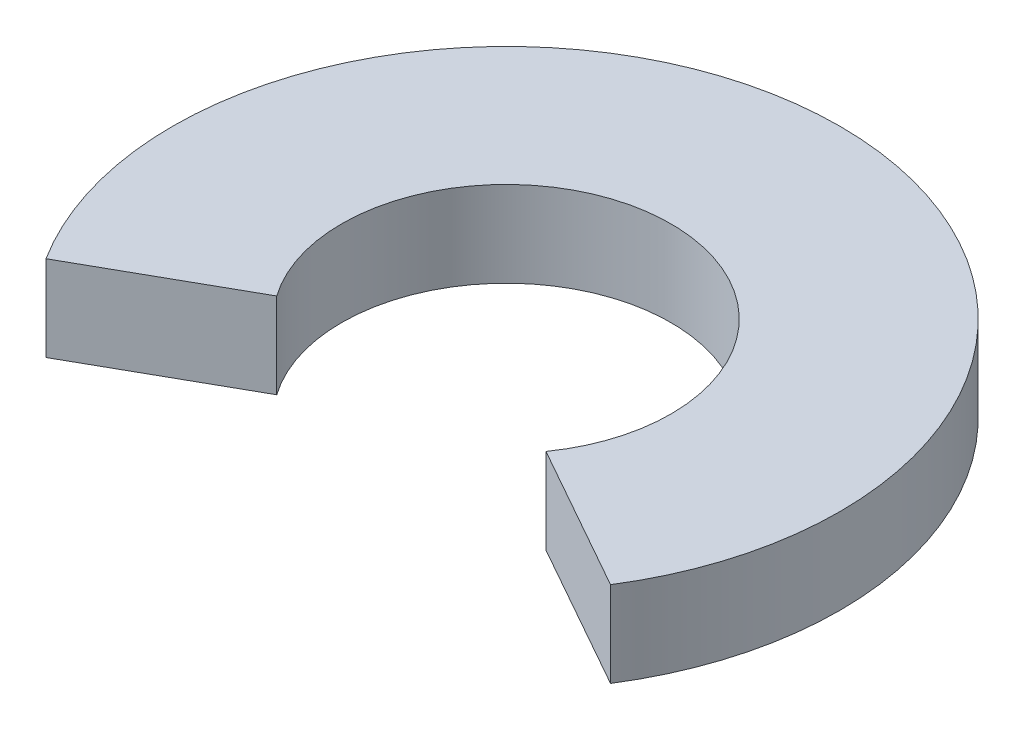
from build123d import *
from build123d.topology import SkipClean

# Parameters (mm, degrees)
SKETCH1_R               = 99.06
SKETCH1_R_2             = 48.895
BOSS_EXTRUDE1_DEPTH     = 25.4
SKETCH3_R               = 97.155
SKETCH3_R_2             = 59.655
CUT_EXTRUDE2_DEPTH      = 21.59
CUT_EXTRUDE1_DEPTH      = 165.504153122
CUT_EXTRUDE1_DEPTH_BACK = 165.504153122
BOSS_EXTRUDE2_START     = -25.4
BOSS_EXTRUDE2_DEPTH     = 25.4


with BuildPart() as part:
    # Sketch1 → Boss-Extrude1 (new body)
    with BuildSketch(Plane(origin=(0, 0, 0), x_dir=(1, 0, 0), z_dir=(0, 1, 0))):
        with Locations(Location((0, 0, 0), (0, 0, 270))):
            Circle(SKETCH1_R)
        with Locations(Location((0, 0, 0), (0, 0, 270))):
            Circle(SKETCH1_R_2, mode=Mode.SUBTRACT)
    extrude(amount=BOSS_EXTRUDE1_DEPTH)

    # Sketch3 → Cut-Extrude2 (cut)
    with BuildSketch(Plane.XZ):
        with Locations(Location((0, 0, 0), (0, 0, 270))):
            Circle(SKETCH3_R)
        with Locations(Location((0, 0, 0), (0, 0, 270))):
            Circle(SKETCH3_R_2, mode=Mode.SUBTRACT)
    extrude(amount=-CUT_EXTRUDE2_DEPTH, mode=Mode.SUBTRACT)

    # Sketch2 → Cut-Extrude1 (cut, two sides: drawn at the far end of the back side and taken through both)
    with BuildSketch(Plane(origin=(0, 25.4, -29.794851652), x_dir=(1, 0, 0), z_dir=(0, 1, 0)).offset(-CUT_EXTRUDE1_DEPTH_BACK)):
        with BuildLine():
            Line((-42.036702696, -54.767569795), (-85.758994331, -79.375881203))
            ThreePointArc((-85.758994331, -79.375881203), (0, -128.854851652), (85.758994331, -79.375881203))
            Line((85.758994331, -79.375881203), (42.036702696, -54.767569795))
            ThreePointArc((42.036702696, -54.767569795), (0, -78.689851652), (-42.036702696, -54.767569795))
        make_face()
    extrude(amount=CUT_EXTRUDE1_DEPTH + CUT_EXTRUDE1_DEPTH_BACK, mode=Mode.SUBTRACT)

    # Sketch4 → Boss-Extrude2 (add)
    with SkipClean():  # the faces are left unmerged after this step: merging them gives an invalid solid
        with BuildSketch(Plane(origin=(0, 25.4, 0), x_dir=(1, 0, 0), z_dir=(0, 1, 0)).offset(BOSS_EXTRUDE2_START)):
            with BuildLine():
                Line((-85.758994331, -49.581029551), (-42.036702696, -24.972718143))
                ThreePointArc((-42.036702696, -24.972718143), (-41.029797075, -26.594675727), (-39.960342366, -28.176090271))
                Line((-39.960342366, -28.176090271), (-83.787988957, -52.843698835))
                ThreePointArc((-83.787988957, -52.843698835), (-84.789186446, -51.221845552), (-85.758994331, -49.581029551))
            make_face()
            with BuildLine():
                Line((42.036702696, -24.972718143), (85.758994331, -49.581029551))
                ThreePointArc((85.758994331, -49.581029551), (84.789186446, -51.221845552), (83.787988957, -52.843698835))
                Line((83.787988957, -52.843698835), (39.960342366, -28.176090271))
                ThreePointArc((39.960342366, -28.176090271), (41.029797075, -26.594675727), (42.036702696, -24.972718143))
            make_face()
        extrude(amount=BOSS_EXTRUDE2_DEPTH)


solid = part.part
